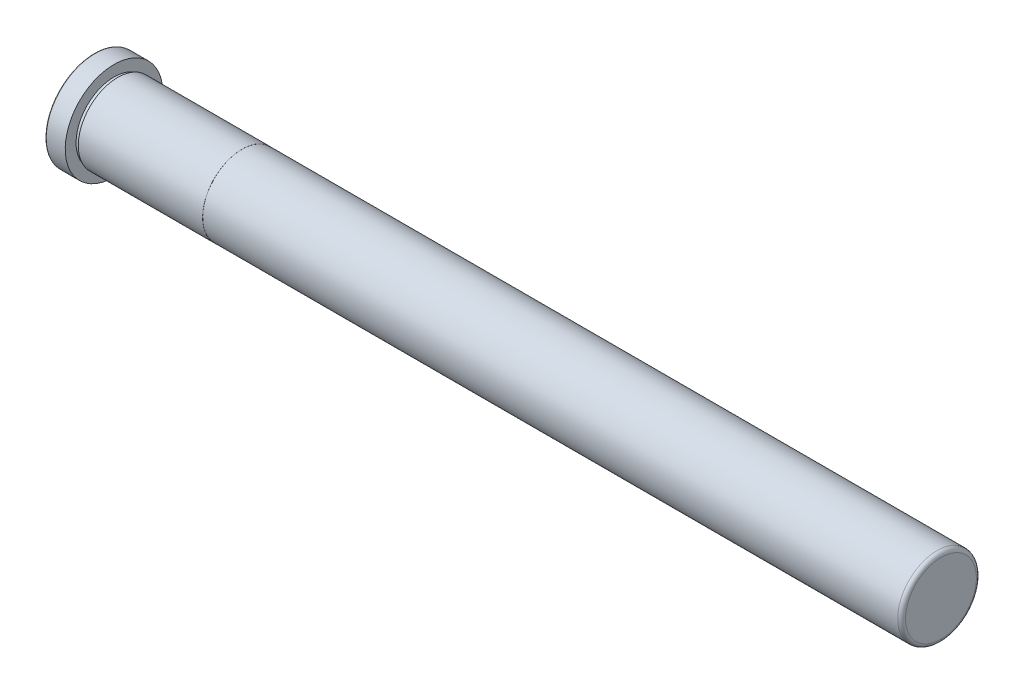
ISO-10303-21;
HEADER;
FILE_DESCRIPTION(('STEP AP214'),'2;1');
FILE_NAME('part.step','',(''),(''),'','','');
FILE_SCHEMA(('AUTOMOTIVE_DESIGN { 1 0 10303 214 1 1 1 1 }'));
ENDSEC;
DATA;
#1=APPLICATION_CONTEXT('core data for automotive mechanical design processes');
#2=APPLICATION_PROTOCOL_DEFINITION('international standard','automotive_design',2000,#1);
#3=PRODUCT_CONTEXT('',#1,'mechanical');
#4=PRODUCT('Part','Part','',(#3));
#5=PRODUCT_RELATED_PRODUCT_CATEGORY('part','',(#4));
#6=PRODUCT_DEFINITION_FORMATION('','',#4);
#7=PRODUCT_DEFINITION_CONTEXT('part definition',#1,'design');
#8=PRODUCT_DEFINITION('design','',#6,#7);
#9=PRODUCT_DEFINITION_SHAPE('','',#8);
#10=(LENGTH_UNIT() NAMED_UNIT(*) SI_UNIT(.MILLI.,.METRE.));
#11=(NAMED_UNIT(*) PLANE_ANGLE_UNIT() SI_UNIT($,.RADIAN.));
#12=(NAMED_UNIT(*) SI_UNIT($,.STERADIAN.) SOLID_ANGLE_UNIT());
#13=UNCERTAINTY_MEASURE_WITH_UNIT(LENGTH_MEASURE(1.E-05),#10,'distance_accuracy_value','');
#14=(GEOMETRIC_REPRESENTATION_CONTEXT(3) GLOBAL_UNCERTAINTY_ASSIGNED_CONTEXT((#13)) GLOBAL_UNIT_ASSIGNED_CONTEXT((#10,
#11,#12)) REPRESENTATION_CONTEXT('',''));
#15=CARTESIAN_POINT('',(0.,0.,0.));
#16=DIRECTION('',(0.,0.,1.));
#17=DIRECTION('',(1.,0.,0.));
#18=AXIS2_PLACEMENT_3D('',#15,#16,#17);
#19=CARTESIAN_POINT('',(271.4498,11.4173,0.));
#20=DIRECTION('',(-1.,0.,0.));
#21=DIRECTION('',(0.,-1.,0.));
#22=AXIS2_PLACEMENT_3D('',#19,#20,#21);
#23=PLANE('',#22);
#24=CARTESIAN_POINT('',(271.4498,0.,0.));
#25=DIRECTION('',(-1.,0.,0.));
#26=DIRECTION('',(0.,-1.,0.));
#27=AXIS2_PLACEMENT_3D('',#24,#25,#26);
#28=CIRCLE('',#27,11.4173);
#29=CARTESIAN_POINT('',(271.4498,-11.4173,0.));
#30=VERTEX_POINT('',#29);
#31=EDGE_CURVE('E10',#30,#30,#28,.T.);
#32=ORIENTED_EDGE('',*,*,#31,.F.);
#33=EDGE_LOOP('',(#32));
#34=FACE_BOUND('',#33,.T.);
#35=ADVANCED_FACE('F28',(#34),#23,.F.);
#36=CARTESIAN_POINT('',(270.1798,0.,0.));
#37=DIRECTION('',(-1.,0.,0.));
#38=DIRECTION('',(0.,-1.,0.));
#39=AXIS2_PLACEMENT_3D('',#36,#37,#38);
#40=TOROIDAL_SURFACE('',#39,11.4173,1.27);
#41=CARTESIAN_POINT('',(270.1798,0.,0.));
#42=DIRECTION('',(-1.,0.,0.));
#43=DIRECTION('',(0.,-1.,0.));
#44=AXIS2_PLACEMENT_3D('',#41,#42,#43);
#45=CIRCLE('',#44,12.6873);
#46=CARTESIAN_POINT('',(270.1798,-12.6873,0.));
#47=VERTEX_POINT('',#46);
#48=EDGE_CURVE('E34',#47,#47,#45,.T.);
#49=ORIENTED_EDGE('',*,*,#48,.F.);
#50=EDGE_LOOP('',(#49));
#51=FACE_BOUND('',#50,.T.);
#52=ORIENTED_EDGE('',*,*,#31,.T.);
#53=EDGE_LOOP('',(#52));
#54=FACE_BOUND('',#53,.T.);
#55=ADVANCED_FACE('F112',(#51,#54),#40,.T.);
#56=CARTESIAN_POINT('',(271.4498,0.,0.));
#57=DIRECTION('',(-1.,0.,0.));
#58=DIRECTION('',(0.,-1.,0.));
#59=AXIS2_PLACEMENT_3D('',#56,#57,#58);
#60=CYLINDRICAL_SURFACE('',#59,12.6873);
#61=CARTESIAN_POINT('',(46.0248,0.,0.));
#62=DIRECTION('',(-1.,0.,0.));
#63=DIRECTION('',(0.,-1.,0.));
#64=AXIS2_PLACEMENT_3D('',#61,#62,#63);
#65=CIRCLE('',#64,12.6873);
#66=CARTESIAN_POINT('',(46.0248,-12.6873,0.));
#67=VERTEX_POINT('',#66);
#68=EDGE_CURVE('E38',#67,#67,#65,.T.);
#69=ORIENTED_EDGE('',*,*,#68,.F.);
#70=EDGE_LOOP('',(#69));
#71=FACE_BOUND('',#70,.T.);
#72=ORIENTED_EDGE('',*,*,#48,.T.);
#73=EDGE_LOOP('',(#72));
#74=FACE_BOUND('',#73,.T.);
#75=ADVANCED_FACE('F107',(#71,#74),#60,.T.);
#76=CARTESIAN_POINT('',(46.0248,12.7127,0.));
#77=DIRECTION('',(-1.,0.,0.));
#78=DIRECTION('',(0.,-1.,0.));
#79=AXIS2_PLACEMENT_3D('',#76,#77,#78);
#80=PLANE('',#79);
#81=CARTESIAN_POINT('',(46.0248,0.,0.));
#82=DIRECTION('',(-1.,0.,0.));
#83=DIRECTION('',(0.,-1.,0.));
#84=AXIS2_PLACEMENT_3D('',#81,#82,#83);
#85=CIRCLE('',#84,12.7127);
#86=CARTESIAN_POINT('',(46.0248,-12.7127,0.));
#87=VERTEX_POINT('',#86);
#88=EDGE_CURVE('E42',#87,#87,#85,.T.);
#89=ORIENTED_EDGE('',*,*,#88,.F.);
#90=EDGE_LOOP('',(#89));
#91=FACE_BOUND('',#90,.T.);
#92=ORIENTED_EDGE('',*,*,#68,.T.);
#93=EDGE_LOOP('',(#92));
#94=FACE_BOUND('',#93,.T.);
#95=ADVANCED_FACE('F101',(#91,#94),#80,.F.);
#96=CARTESIAN_POINT('',(271.4498,0.,0.));
#97=DIRECTION('',(-1.,0.,0.));
#98=DIRECTION('',(0.,-1.,0.));
#99=AXIS2_PLACEMENT_3D('',#96,#97,#98);
#100=CYLINDRICAL_SURFACE('',#99,12.7127);
#101=CARTESIAN_POINT('',(5.93151671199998,0.,0.));
#102=DIRECTION('',(-1.,0.,0.));
#103=DIRECTION('',(0.,-1.,0.));
#104=AXIS2_PLACEMENT_3D('',#101,#102,#103);
#105=CIRCLE('',#104,12.7127);
#106=CARTESIAN_POINT('',(5.93151671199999,-12.7127,0.));
#107=VERTEX_POINT('',#106);
#108=EDGE_CURVE('E47',#107,#107,#105,.T.);
#109=ORIENTED_EDGE('',*,*,#108,.F.);
#110=EDGE_LOOP('',(#109));
#111=FACE_BOUND('',#110,.T.);
#112=ORIENTED_EDGE('',*,*,#88,.T.);
#113=EDGE_LOOP('',(#112));
#114=FACE_BOUND('',#113,.T.);
#115=ADVANCED_FACE('F95',(#111,#114),#100,.T.);
#116=CARTESIAN_POINT('',(5.93151671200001,12.247245,0.));
#117=DIRECTION('',(1.,0.,0.));
#118=DIRECTION('',(0.,1.,0.));
#119=AXIS2_PLACEMENT_3D('',#116,#117,#118);
#120=PLANE('',#119);
#121=CARTESIAN_POINT('',(5.93151671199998,0.,0.));
#122=DIRECTION('',(-1.,0.,0.));
#123=DIRECTION('',(0.,-1.,0.));
#124=AXIS2_PLACEMENT_3D('',#121,#122,#123);
#125=CIRCLE('',#124,12.247245);
#126=CARTESIAN_POINT('',(5.93151671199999,-12.247245,0.));
#127=VERTEX_POINT('',#126);
#128=EDGE_CURVE('E50',#127,#127,#125,.T.);
#129=ORIENTED_EDGE('',*,*,#128,.F.);
#130=EDGE_LOOP('',(#129));
#131=FACE_BOUND('',#130,.T.);
#132=ORIENTED_EDGE('',*,*,#108,.T.);
#133=EDGE_LOOP('',(#132));
#134=FACE_BOUND('',#133,.T.);
#135=ADVANCED_FACE('F89',(#131,#134),#120,.F.);
#136=CARTESIAN_POINT('',(271.4498,0.,0.));
#137=DIRECTION('',(-1.,0.,0.));
#138=DIRECTION('',(0.,-1.,0.));
#139=AXIS2_PLACEMENT_3D('',#136,#137,#138);
#140=CYLINDRICAL_SURFACE('',#139,12.247245);
#141=CARTESIAN_POINT('',(4.74980000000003,0.,0.));
#142=DIRECTION('',(-1.,0.,0.));
#143=DIRECTION('',(0.,-1.,0.));
#144=AXIS2_PLACEMENT_3D('',#141,#142,#143);
#145=CIRCLE('',#144,12.247245);
#146=CARTESIAN_POINT('',(4.74980000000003,-12.247245,0.));
#147=VERTEX_POINT('',#146);
#148=EDGE_CURVE('E53',#147,#147,#145,.T.);
#149=ORIENTED_EDGE('',*,*,#148,.F.);
#150=EDGE_LOOP('',(#149));
#151=FACE_BOUND('',#150,.T.);
#152=ORIENTED_EDGE('',*,*,#128,.T.);
#153=EDGE_LOOP('',(#152));
#154=FACE_BOUND('',#153,.T.);
#155=ADVANCED_FACE('F83',(#151,#154),#140,.T.);
#156=CARTESIAN_POINT('',(4.74980000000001,15.748,0.));
#157=DIRECTION('',(-1.,0.,0.));
#158=DIRECTION('',(0.,-1.,0.));
#159=AXIS2_PLACEMENT_3D('',#156,#157,#158);
#160=PLANE('',#159);
#161=CARTESIAN_POINT('',(4.74980000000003,0.,0.));
#162=DIRECTION('',(-1.,0.,0.));
#163=DIRECTION('',(0.,-1.,0.));
#164=AXIS2_PLACEMENT_3D('',#161,#162,#163);
#165=CIRCLE('',#164,15.748);
#166=CARTESIAN_POINT('',(4.74980000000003,-15.748,0.));
#167=VERTEX_POINT('',#166);
#168=EDGE_CURVE('E56',#167,#167,#165,.T.);
#169=ORIENTED_EDGE('',*,*,#168,.F.);
#170=EDGE_LOOP('',(#169));
#171=FACE_BOUND('',#170,.T.);
#172=ORIENTED_EDGE('',*,*,#148,.T.);
#173=EDGE_LOOP('',(#172));
#174=FACE_BOUND('',#173,.T.);
#175=ADVANCED_FACE('F77',(#171,#174),#160,.F.);
#176=CARTESIAN_POINT('',(271.4498,0.,0.));
#177=DIRECTION('',(-1.,0.,0.));
#178=DIRECTION('',(0.,-1.,0.));
#179=AXIS2_PLACEMENT_3D('',#176,#177,#178);
#180=CYLINDRICAL_SURFACE('',#179,15.748);
#181=CARTESIAN_POINT('',(-1.34620000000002,0.,0.));
#182=DIRECTION('',(-1.,0.,0.));
#183=DIRECTION('',(0.,-1.,0.));
#184=AXIS2_PLACEMENT_3D('',#181,#182,#183);
#185=CIRCLE('',#184,15.748);
#186=CARTESIAN_POINT('',(-1.34620000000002,-15.748,0.));
#187=VERTEX_POINT('',#186);
#188=EDGE_CURVE('E59',#187,#187,#185,.T.);
#189=ORIENTED_EDGE('',*,*,#188,.F.);
#190=EDGE_LOOP('',(#189));
#191=FACE_BOUND('',#190,.T.);
#192=ORIENTED_EDGE('',*,*,#168,.T.);
#193=EDGE_LOOP('',(#192));
#194=FACE_BOUND('',#193,.T.);
#195=ADVANCED_FACE('F71',(#191,#194),#180,.T.);
#196=CARTESIAN_POINT('',(-1.34619999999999,0.,0.));
#197=DIRECTION('',(-1.,0.,0.));
#198=DIRECTION('',(0.,-1.,0.));
#199=AXIS2_PLACEMENT_3D('',#196,#197,#198);
#200=TOROIDAL_SURFACE('',#199,15.494,0.254);
#201=CARTESIAN_POINT('',(-1.6002,0.,0.));
#202=DIRECTION('',(-1.,0.,0.));
#203=DIRECTION('',(0.,-1.,0.));
#204=AXIS2_PLACEMENT_3D('',#201,#202,#203);
#205=CIRCLE('',#204,15.494);
#206=CARTESIAN_POINT('',(-1.60019999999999,-15.494,0.));
#207=VERTEX_POINT('',#206);
#208=EDGE_CURVE('E62',#207,#207,#205,.T.);
#209=ORIENTED_EDGE('',*,*,#208,.F.);
#210=EDGE_LOOP('',(#209));
#211=FACE_BOUND('',#210,.T.);
#212=ORIENTED_EDGE('',*,*,#188,.T.);
#213=EDGE_LOOP('',(#212));
#214=FACE_BOUND('',#213,.T.);
#215=ADVANCED_FACE('F68',(#211,#214),#200,.T.);
#216=CARTESIAN_POINT('',(-1.60019999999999,0.,0.));
#217=DIRECTION('',(1.,0.,0.));
#218=DIRECTION('',(0.,1.,0.));
#219=AXIS2_PLACEMENT_3D('',#216,#217,#218);
#220=PLANE('',#219);
#221=ORIENTED_EDGE('',*,*,#208,.T.);
#222=EDGE_LOOP('',(#221));
#223=FACE_BOUND('',#222,.T.);
#224=ADVANCED_FACE('F66',(#223),#220,.F.);
#225=CLOSED_SHELL('',(#35,#55,#75,#95,#115,#135,#155,#175,#195,#215,#224));
#226=MANIFOLD_SOLID_BREP('B2',#225);
#227=ADVANCED_BREP_SHAPE_REPRESENTATION('',(#18,#226),#14);
#228=SHAPE_DEFINITION_REPRESENTATION(#9,#227);
ENDSEC;
END-ISO-10303-21;
